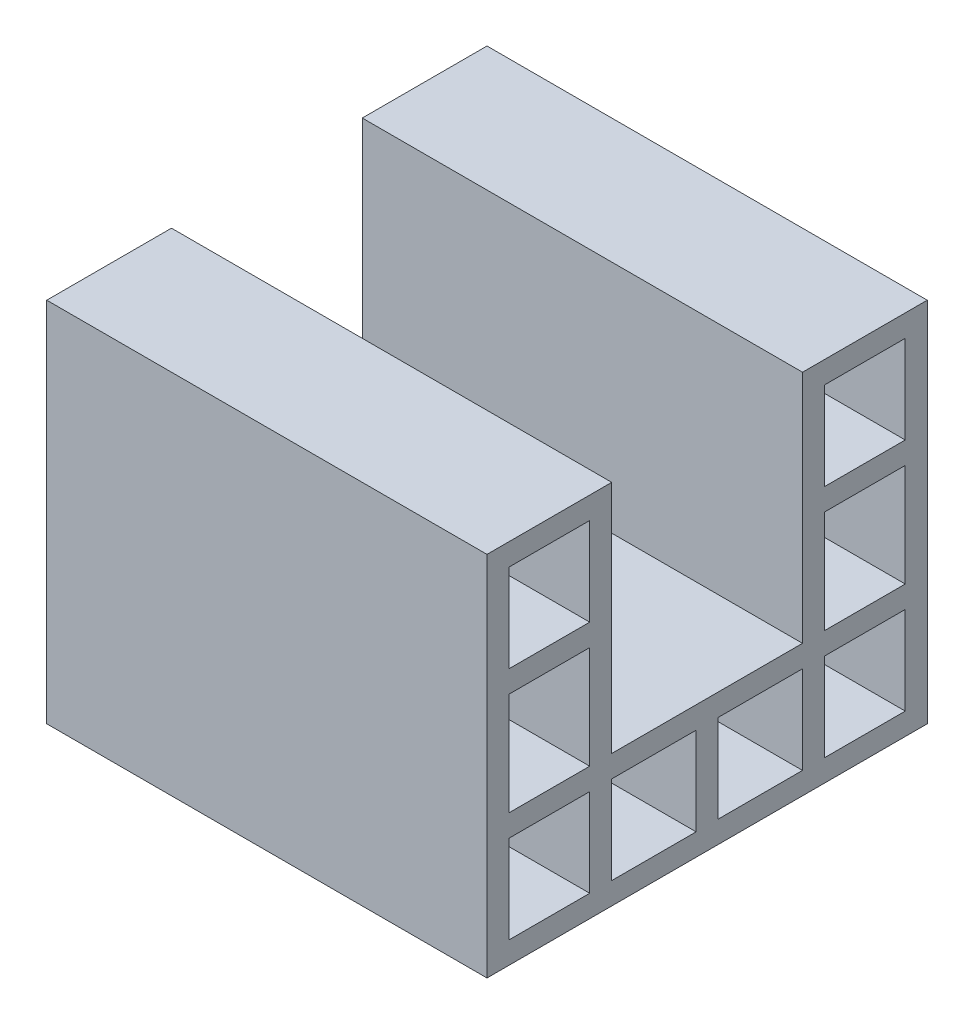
from build123d import *

# Parameters (mm, degrees)
ESQUISSE1_W      = 5.5
ESQUISSE1_H      = 7
ESQUISSE1_H_2    = 6
ESQUISSE1_W_2    = 5.75
EXTRUSION1_DEPTH = 30
D_POUILLE1_ANGLE = 1


with BuildPart() as part:
    # Esquisse1 → Extrusion1 (new body)
    with BuildSketch(Plane(origin=(0, 0, 0), x_dir=(0, 0, -1), z_dir=(1, 0, 0))):
        Polygon((8.5, 9), (8.5, 25), (0, 25), (0, 0), (30, 0), (30, 25), (21.5, 25), (21.5, 9), align=None)
        with Locations((4.25, 12.5)):
            Rectangle(ESQUISSE1_W, ESQUISSE1_H, mode=Mode.SUBTRACT)
        with Locations((4.25, 4.5)):
            Rectangle(ESQUISSE1_W, ESQUISSE1_H_2, mode=Mode.SUBTRACT)
        with Locations((4.25, 20.5)):
            Rectangle(ESQUISSE1_W, ESQUISSE1_H_2, mode=Mode.SUBTRACT)
        with Locations((11.375, 4.5)):
            Rectangle(ESQUISSE1_W_2, ESQUISSE1_H_2, mode=Mode.SUBTRACT)
        with Locations((18.625, 4.5)):
            Rectangle(ESQUISSE1_W_2, ESQUISSE1_H_2, mode=Mode.SUBTRACT)
        with Locations((25.75, 20.5)):
            Rectangle(ESQUISSE1_W, ESQUISSE1_H_2, mode=Mode.SUBTRACT)
        with Locations((25.75, 12.5)):
            Rectangle(ESQUISSE1_W, ESQUISSE1_H, mode=Mode.SUBTRACT)
        with Locations((25.75, 4.5)):
            Rectangle(ESQUISSE1_W, ESQUISSE1_H_2, mode=Mode.SUBTRACT)
    extrude(amount=EXTRUSION1_DEPTH)

    # D_pouille1
    d_pouille1_faces = [part.faces().sort_by_distance(p)[0] for p in [
        (15, 23.5, -25.75),
        (15, 20.5, -23),
        (15, 16, -25.75),
        (15, 12.5, -23),
        (15, 7.5, -25.75),
        (15, 4.5, -23),
        (15, 7.5, -18.625),
        (15, 4.5, -15.75),
        (15, 7.5, -11.375),
        (15, 4.5, -8.5),
        (15, 23.5, -4.25),
        (15, 20.5, -1.5),
        (15, 16, -4.25),
        (15, 12.5, -1.5),
        (15, 7.5, -4.25),
        (15, 4.5, -1.5),
        (15, 20.5, -28.5),
        (15, 17.5, -25.75),
        (15, 12.5, -28.5),
        (15, 9, -25.75),
        (15, 4.5, -28.5),
        (15, 1.5, -25.75),
        (15, 4.5, -21.5),
        (15, 1.5, -18.625),
        (15, 4.5, -14.25),
        (15, 1.5, -11.375),
        (15, 4.5, -7),
        (15, 1.5, -4.25),
        (15, 12.5, -7),
        (15, 9, -4.25),
        (15, 20.5, -7),
        (15, 17.5, -4.25),
    ]]
    draft(d_pouille1_faces, Plane(origin=(30, 9, -21.5), x_dir=(0, 0, 1), z_dir=(1, 0, 0)), D_POUILLE1_ANGLE)


solid = part.part
